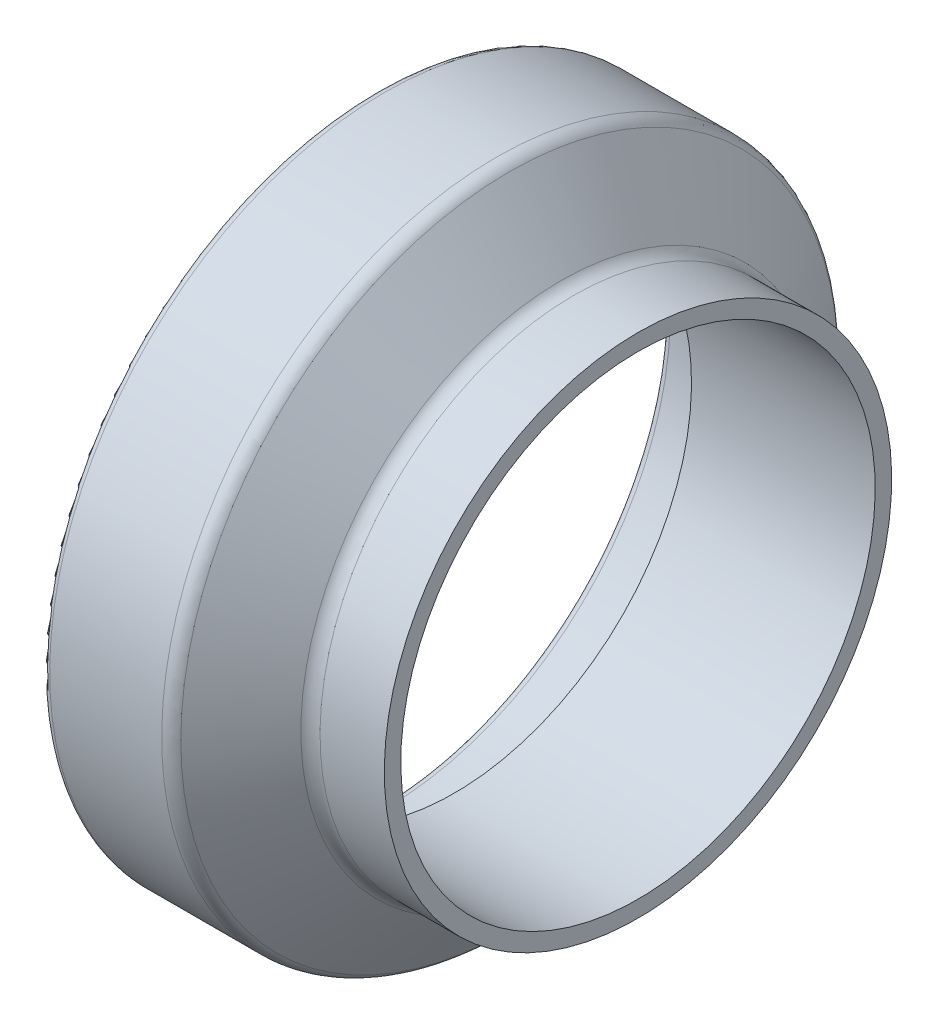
ISO-10303-21;
HEADER;
FILE_DESCRIPTION(('STEP AP214'),'2;1');
FILE_NAME('part.step','',(''),(''),'','','');
FILE_SCHEMA(('AUTOMOTIVE_DESIGN { 1 0 10303 214 1 1 1 1 }'));
ENDSEC;
DATA;
#1=APPLICATION_CONTEXT('core data for automotive mechanical design processes');
#2=APPLICATION_PROTOCOL_DEFINITION('international standard','automotive_design',2000,#1);
#3=PRODUCT_CONTEXT('',#1,'mechanical');
#4=PRODUCT('Part','Part','',(#3));
#5=PRODUCT_RELATED_PRODUCT_CATEGORY('part','',(#4));
#6=PRODUCT_DEFINITION_FORMATION('','',#4);
#7=PRODUCT_DEFINITION_CONTEXT('part definition',#1,'design');
#8=PRODUCT_DEFINITION('design','',#6,#7);
#9=PRODUCT_DEFINITION_SHAPE('','',#8);
#10=(LENGTH_UNIT() NAMED_UNIT(*) SI_UNIT(.MILLI.,.METRE.));
#11=(NAMED_UNIT(*) PLANE_ANGLE_UNIT() SI_UNIT($,.RADIAN.));
#12=(NAMED_UNIT(*) SI_UNIT($,.STERADIAN.) SOLID_ANGLE_UNIT());
#13=UNCERTAINTY_MEASURE_WITH_UNIT(LENGTH_MEASURE(1.E-05),#10,'distance_accuracy_value','');
#14=(GEOMETRIC_REPRESENTATION_CONTEXT(3) GLOBAL_UNCERTAINTY_ASSIGNED_CONTEXT((#13)) GLOBAL_UNIT_ASSIGNED_CONTEXT((#10,
#11,#12)) REPRESENTATION_CONTEXT('',''));
#15=CARTESIAN_POINT('',(0.,0.,0.));
#16=DIRECTION('',(0.,0.,1.));
#17=DIRECTION('',(1.,0.,0.));
#18=AXIS2_PLACEMENT_3D('',#15,#16,#17);
#19=CARTESIAN_POINT('',(-9.6021835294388,25.4,0.));
#20=DIRECTION('',(1.,0.,0.));
#21=DIRECTION('',(0.,1.,0.));
#22=AXIS2_PLACEMENT_3D('',#19,#20,#21);
#23=PLANE('',#22);
#24=CARTESIAN_POINT('',(-9.6021835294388,0.,0.));
#25=DIRECTION('',(1.,0.,0.));
#26=DIRECTION('',(0.,1.,0.));
#27=AXIS2_PLACEMENT_3D('',#24,#25,#26);
#28=CIRCLE('',#27,25.4);
#29=CARTESIAN_POINT('',(-9.6021835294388,25.4,0.));
#30=VERTEX_POINT('',#29);
#31=EDGE_CURVE('E74',#30,#30,#28,.T.);
#32=ORIENTED_EDGE('',*,*,#31,.T.);
#33=EDGE_LOOP('',(#32));
#34=FACE_BOUND('',#33,.T.);
#35=CARTESIAN_POINT('',(-9.6021835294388,0.,0.));
#36=DIRECTION('',(1.,0.,0.));
#37=DIRECTION('',(0.,1.,0.));
#38=AXIS2_PLACEMENT_3D('',#35,#36,#37);
#39=CIRCLE('',#38,23.749);
#40=CARTESIAN_POINT('',(-9.6021835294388,23.749,0.));
#41=VERTEX_POINT('',#40);
#42=EDGE_CURVE('E10',#41,#41,#39,.T.);
#43=ORIENTED_EDGE('',*,*,#42,.F.);
#44=EDGE_LOOP('',(#43));
#45=FACE_BOUND('',#44,.T.);
#46=ADVANCED_FACE('F31',(#34,#45),#23,.T.);
#47=CARTESIAN_POINT('',(0.,0.,0.));
#48=DIRECTION('',(1.,0.,0.));
#49=DIRECTION('',(0.,1.,0.));
#50=AXIS2_PLACEMENT_3D('',#47,#48,#49);
#51=CYLINDRICAL_SURFACE('',#50,23.749);
#52=ORIENTED_EDGE('',*,*,#42,.T.);
#53=EDGE_LOOP('',(#52));
#54=FACE_BOUND('',#53,.T.);
#55=CARTESIAN_POINT('',(-27.9917835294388,0.,0.));
#56=DIRECTION('',(1.,0.,0.));
#57=DIRECTION('',(0.,1.,0.));
#58=AXIS2_PLACEMENT_3D('',#55,#56,#57);
#59=CIRCLE('',#58,23.749);
#60=CARTESIAN_POINT('',(-27.9917835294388,23.749,0.));
#61=VERTEX_POINT('',#60);
#62=EDGE_CURVE('E37',#61,#61,#59,.T.);
#63=ORIENTED_EDGE('',*,*,#62,.F.);
#64=EDGE_LOOP('',(#63));
#65=FACE_BOUND('',#64,.T.);
#66=ADVANCED_FACE('F92',(#54,#65),#51,.F.);
#67=CARTESIAN_POINT('',(-27.9917835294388,23.749,0.));
#68=DIRECTION('',(-1.,0.,0.));
#69=DIRECTION('',(0.,-1.,0.));
#70=AXIS2_PLACEMENT_3D('',#67,#68,#69);
#71=PLANE('',#70);
#72=ORIENTED_EDGE('',*,*,#62,.T.);
#73=EDGE_LOOP('',(#72));
#74=FACE_BOUND('',#73,.T.);
#75=CARTESIAN_POINT('',(-27.9917835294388,0.,0.));
#76=DIRECTION('',(1.,0.,0.));
#77=DIRECTION('',(0.,1.,0.));
#78=AXIS2_PLACEMENT_3D('',#75,#76,#77);
#79=CIRCLE('',#78,27.8003);
#80=CARTESIAN_POINT('',(-27.9917835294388,27.8003,0.));
#81=VERTEX_POINT('',#80);
#82=EDGE_CURVE('E41',#81,#81,#79,.T.);
#83=ORIENTED_EDGE('',*,*,#82,.F.);
#84=EDGE_LOOP('',(#83));
#85=FACE_BOUND('',#84,.T.);
#86=ADVANCED_FACE('F96',(#74,#85),#71,.T.);
#87=CARTESIAN_POINT('',(-28.8045835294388,0.,0.));
#88=DIRECTION('',(1.,0.,0.));
#89=DIRECTION('',(0.,1.,0.));
#90=AXIS2_PLACEMENT_3D('',#87,#88,#89);
#91=TOROIDAL_SURFACE('',#90,27.8003,0.812799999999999);
#92=ORIENTED_EDGE('',*,*,#82,.T.);
#93=EDGE_LOOP('',(#92));
#94=FACE_BOUND('',#93,.T.);
#95=CARTESIAN_POINT('',(-28.8045835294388,0.,0.));
#96=DIRECTION('',(1.,0.,0.));
#97=DIRECTION('',(0.,1.,0.));
#98=AXIS2_PLACEMENT_3D('',#95,#96,#97);
#99=CIRCLE('',#98,28.6131);
#100=CARTESIAN_POINT('',(-28.8045835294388,28.6131,0.));
#101=VERTEX_POINT('',#100);
#102=EDGE_CURVE('E45',#101,#101,#99,.T.);
#103=ORIENTED_EDGE('',*,*,#102,.F.);
#104=EDGE_LOOP('',(#103));
#105=FACE_BOUND('',#104,.T.);
#106=ADVANCED_FACE('F100',(#94,#105),#91,.F.);
#107=CARTESIAN_POINT('',(0.,0.,0.));
#108=DIRECTION('',(1.,0.,0.));
#109=DIRECTION('',(0.,1.,0.));
#110=AXIS2_PLACEMENT_3D('',#107,#108,#109);
#111=CYLINDRICAL_SURFACE('',#110,28.6131);
#112=ORIENTED_EDGE('',*,*,#102,.T.);
#113=EDGE_LOOP('',(#112));
#114=FACE_BOUND('',#113,.T.);
#115=CARTESIAN_POINT('',(-34.9767835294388,0.,0.));
#116=DIRECTION('',(1.,0.,0.));
#117=DIRECTION('',(0.,1.,0.));
#118=AXIS2_PLACEMENT_3D('',#115,#116,#117);
#119=CIRCLE('',#118,28.6131);
#120=CARTESIAN_POINT('',(-34.9767835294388,28.6131,0.));
#121=VERTEX_POINT('',#120);
#122=EDGE_CURVE('E50',#121,#121,#119,.T.);
#123=ORIENTED_EDGE('',*,*,#122,.F.);
#124=EDGE_LOOP('',(#123));
#125=FACE_BOUND('',#124,.T.);
#126=ADVANCED_FACE('F106',(#114,#125),#111,.F.);
#127=CARTESIAN_POINT('',(-34.9767835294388,0.,0.));
#128=DIRECTION('',(1.,0.,0.));
#129=DIRECTION('',(0.,1.,0.));
#130=AXIS2_PLACEMENT_3D('',#127,#128,#129);
#131=TOROIDAL_SURFACE('',#130,29.4259,0.812800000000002);
#132=ORIENTED_EDGE('',*,*,#122,.T.);
#133=EDGE_LOOP('',(#132));
#134=FACE_BOUND('',#133,.T.);
#135=CARTESIAN_POINT('',(-35.7895835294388,0.,0.));
#136=DIRECTION('',(1.,0.,0.));
#137=DIRECTION('',(0.,1.,0.));
#138=AXIS2_PLACEMENT_3D('',#135,#136,#137);
#139=CIRCLE('',#138,29.4259);
#140=CARTESIAN_POINT('',(-35.7895835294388,29.4259,0.));
#141=VERTEX_POINT('',#140);
#142=EDGE_CURVE('E53',#141,#141,#139,.T.);
#143=ORIENTED_EDGE('',*,*,#142,.F.);
#144=EDGE_LOOP('',(#143));
#145=FACE_BOUND('',#144,.T.);
#146=ADVANCED_FACE('F110',(#134,#145),#131,.T.);
#147=CARTESIAN_POINT('',(-35.7895835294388,29.4259,0.));
#148=DIRECTION('',(-1.,0.,0.));
#149=DIRECTION('',(0.,-1.,0.));
#150=AXIS2_PLACEMENT_3D('',#147,#148,#149);
#151=PLANE('',#150);
#152=ORIENTED_EDGE('',*,*,#142,.T.);
#153=EDGE_LOOP('',(#152));
#154=FACE_BOUND('',#153,.T.);
#155=CARTESIAN_POINT('',(-35.7895835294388,0.,0.));
#156=DIRECTION('',(1.,0.,0.));
#157=DIRECTION('',(0.,1.,0.));
#158=AXIS2_PLACEMENT_3D('',#155,#156,#157);
#159=CIRCLE('',#158,32.7152);
#160=CARTESIAN_POINT('',(-35.7895835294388,32.7152,0.));
#161=VERTEX_POINT('',#160);
#162=EDGE_CURVE('E56',#161,#161,#159,.T.);
#163=ORIENTED_EDGE('',*,*,#162,.F.);
#164=EDGE_LOOP('',(#163));
#165=FACE_BOUND('',#164,.T.);
#166=ADVANCED_FACE('F114',(#154,#165),#151,.T.);
#167=CARTESIAN_POINT('',(-34.9767835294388,0.,0.));
#168=DIRECTION('',(1.,0.,0.));
#169=DIRECTION('',(0.,1.,0.));
#170=AXIS2_PLACEMENT_3D('',#167,#168,#169);
#171=TOROIDAL_SURFACE('',#170,32.7152,0.812800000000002);
#172=ORIENTED_EDGE('',*,*,#162,.T.);
#173=EDGE_LOOP('',(#172));
#174=FACE_BOUND('',#173,.T.);
#175=CARTESIAN_POINT('',(-34.9767835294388,0.,0.));
#176=DIRECTION('',(1.,0.,0.));
#177=DIRECTION('',(0.,1.,0.));
#178=AXIS2_PLACEMENT_3D('',#175,#176,#177);
#179=CIRCLE('',#178,33.528);
#180=CARTESIAN_POINT('',(-34.9767835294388,33.528,0.));
#181=VERTEX_POINT('',#180);
#182=EDGE_CURVE('E59',#181,#181,#179,.T.);
#183=ORIENTED_EDGE('',*,*,#182,.F.);
#184=EDGE_LOOP('',(#183));
#185=FACE_BOUND('',#184,.T.);
#186=ADVANCED_FACE('F118',(#174,#185),#171,.T.);
#187=CARTESIAN_POINT('',(0.,0.,0.));
#188=DIRECTION('',(1.,0.,0.));
#189=DIRECTION('',(0.,1.,0.));
#190=AXIS2_PLACEMENT_3D('',#187,#188,#189);
#191=CYLINDRICAL_SURFACE('',#190,33.528);
#192=ORIENTED_EDGE('',*,*,#182,.T.);
#193=EDGE_LOOP('',(#192));
#194=FACE_BOUND('',#193,.T.);
#195=CARTESIAN_POINT('',(-23.7604138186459,0.,0.));
#196=DIRECTION('',(1.,0.,0.));
#197=DIRECTION('',(0.,1.,0.));
#198=AXIS2_PLACEMENT_3D('',#195,#196,#197);
#199=CIRCLE('',#198,33.528);
#200=CARTESIAN_POINT('',(-23.7604138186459,33.528,0.));
#201=VERTEX_POINT('',#200);
#202=EDGE_CURVE('E62',#201,#201,#199,.T.);
#203=ORIENTED_EDGE('',*,*,#202,.F.);
#204=EDGE_LOOP('',(#203));
#205=FACE_BOUND('',#204,.T.);
#206=ADVANCED_FACE('F122',(#194,#205),#191,.T.);
#207=CARTESIAN_POINT('',(-23.7604138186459,0.,0.));
#208=DIRECTION('',(1.,0.,0.));
#209=DIRECTION('',(0.,1.,0.));
#210=AXIS2_PLACEMENT_3D('',#207,#208,#209);
#211=TOROIDAL_SURFACE('',#210,31.9278,1.60020000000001);
#212=ORIENTED_EDGE('',*,*,#202,.T.);
#213=EDGE_LOOP('',(#212));
#214=FACE_BOUND('',#213,.T.);
#215=CARTESIAN_POINT('',(-22.4824372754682,0.,0.));
#216=DIRECTION('',(1.,0.,0.));
#217=DIRECTION('',(0.,1.,0.));
#218=AXIS2_PLACEMENT_3D('',#215,#216,#217);
#219=CIRCLE('',#218,32.8908244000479);
#220=CARTESIAN_POINT('',(-22.4824372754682,32.8908244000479,0.));
#221=VERTEX_POINT('',#220);
#222=EDGE_CURVE('E65',#221,#221,#219,.T.);
#223=ORIENTED_EDGE('',*,*,#222,.F.);
#224=EDGE_LOOP('',(#223));
#225=FACE_BOUND('',#224,.T.);
#226=ADVANCED_FACE('F126',(#214,#225),#211,.T.);
#227=CARTESIAN_POINT('',(-17.3178424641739,0.,0.));
#228=DIRECTION('',(-1.,0.,0.));
#229=DIRECTION('',(0.,-1.,0.));
#230=AXIS2_PLACEMENT_3D('',#227,#228,#229);
#231=CONICAL_SURFACE('',#230,26.0371755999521,0.925024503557);
#232=ORIENTED_EDGE('',*,*,#222,.T.);
#233=EDGE_LOOP('',(#232));
#234=FACE_BOUND('',#233,.T.);
#235=CARTESIAN_POINT('',(-17.3178424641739,0.,0.));
#236=DIRECTION('',(1.,0.,0.));
#237=DIRECTION('',(0.,1.,0.));
#238=AXIS2_PLACEMENT_3D('',#235,#236,#237);
#239=CIRCLE('',#238,26.0371755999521);
#240=CARTESIAN_POINT('',(-17.3178424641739,26.0371755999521,0.));
#241=VERTEX_POINT('',#240);
#242=EDGE_CURVE('E68',#241,#241,#239,.T.);
#243=ORIENTED_EDGE('',*,*,#242,.F.);
#244=EDGE_LOOP('',(#243));
#245=FACE_BOUND('',#244,.T.);
#246=ADVANCED_FACE('F88',(#234,#245),#231,.T.);
#247=CARTESIAN_POINT('',(-16.0398659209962,0.,0.));
#248=DIRECTION('',(1.,0.,0.));
#249=DIRECTION('',(0.,1.,0.));
#250=AXIS2_PLACEMENT_3D('',#247,#248,#249);
#251=TOROIDAL_SURFACE('',#250,27.0002,1.6002);
#252=ORIENTED_EDGE('',*,*,#242,.T.);
#253=EDGE_LOOP('',(#252));
#254=FACE_BOUND('',#253,.T.);
#255=CARTESIAN_POINT('',(-16.0398659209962,0.,0.));
#256=DIRECTION('',(1.,0.,0.));
#257=DIRECTION('',(0.,1.,0.));
#258=AXIS2_PLACEMENT_3D('',#255,#256,#257);
#259=CIRCLE('',#258,25.4);
#260=CARTESIAN_POINT('',(-16.0398659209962,25.4,0.));
#261=VERTEX_POINT('',#260);
#262=EDGE_CURVE('E71',#261,#261,#259,.T.);
#263=ORIENTED_EDGE('',*,*,#262,.F.);
#264=EDGE_LOOP('',(#263));
#265=FACE_BOUND('',#264,.T.);
#266=ADVANCED_FACE('F82',(#254,#265),#251,.F.);
#267=CARTESIAN_POINT('',(0.,0.,0.));
#268=DIRECTION('',(1.,0.,0.));
#269=DIRECTION('',(0.,1.,0.));
#270=AXIS2_PLACEMENT_3D('',#267,#268,#269);
#271=CYLINDRICAL_SURFACE('',#270,25.4);
#272=ORIENTED_EDGE('',*,*,#262,.T.);
#273=EDGE_LOOP('',(#272));
#274=FACE_BOUND('',#273,.T.);
#275=ORIENTED_EDGE('',*,*,#31,.F.);
#276=EDGE_LOOP('',(#275));
#277=FACE_BOUND('',#276,.T.);
#278=ADVANCED_FACE('F80',(#274,#277),#271,.T.);
#279=CLOSED_SHELL('',(#46,#66,#86,#106,#126,#146,#166,#186,#206,#226,#246,#266,#278));
#280=MANIFOLD_SOLID_BREP('B2',#279);
#281=ADVANCED_BREP_SHAPE_REPRESENTATION('',(#18,#280),#14);
#282=SHAPE_DEFINITION_REPRESENTATION(#9,#281);
ENDSEC;
END-ISO-10303-21;
